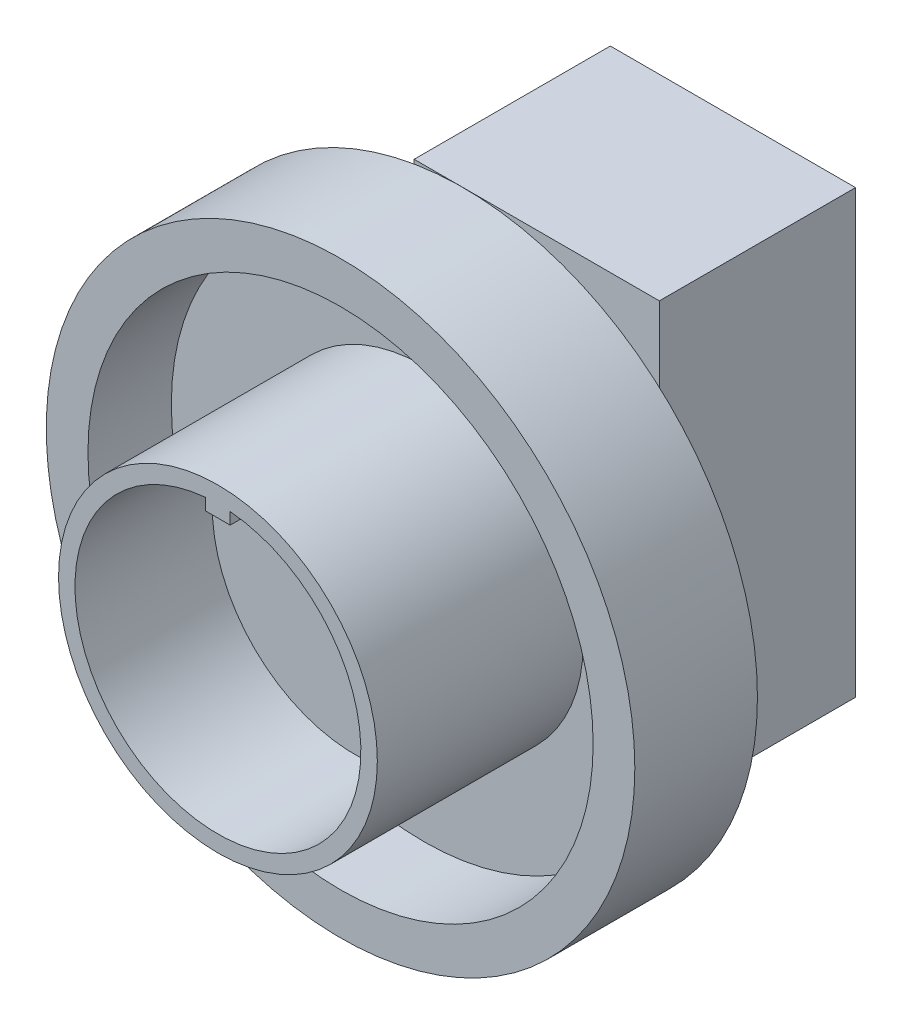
from build123d import *

# Parameters (mm, degrees)
CROQUIS2_W              = 5
CROQUIS2_H              = 5
SALIENTE_EXTRUIR1_DEPTH = 28
CROQUIS3_W              = 50
CROQUIS3_H              = 90
SALIENTE_EXTRUIR2_DEPTH = 40
CROQUIS4_W              = 40.5
CROQUIS4_H              = 81
CORTAR_EXTRUIR1_DEPTH   = 32
CROQUIS5_W              = 22.1
CROQUIS5_H              = 22.1
CORTAR_EXTRUIR2_DEPTH   = 17


with BuildPart() as part:
    # Croquis1 → Revoluci_n1 (revolve)
    with BuildSketch(Plane(origin=(0, 0, 0), x_dir=(0, 0, -1), z_dir=(1, 0, 0)), mode=Mode.PRIVATE) as revoluci_n1_sk:
        Polygon((0, 32.5), (0, 29.15), (28, 29.15), (28, 0), (65, 0), (65, 25), (50, 25), (50, 60), (25, 60), (25, 51.5), (42, 51.5), (42, 32.5), align=None)
    revolve(revoluci_n1_sk.sketch.rotate(Axis((0, 0, 0), (0, 0, -1)), 90), axis=Axis((0, 0, 0), (0, 0, -1)))

    # Croquis2 → Saliente-Extruir1 (add)
    with BuildSketch(Plane.XY):
        with Locations((0, 29.15)):
            Rectangle(CROQUIS2_W, CROQUIS2_H)
    extrude(amount=-SALIENTE_EXTRUIR1_DEPTH)

    # Croquis3 → Saliente-Extruir2 (add)
    with BuildSketch(Plane(origin=(0, 0, -65), x_dir=(-1, 0, 0), z_dir=(0, 0, -1))):
        Rectangle(CROQUIS3_W, CROQUIS3_H)
    extrude(amount=SALIENTE_EXTRUIR2_DEPTH)

    # Croquis4 → Cortar-Extruir1 (cut)
    with BuildSketch(Plane(origin=(0, 0, -105), x_dir=(-1, 0, 0), z_dir=(0, 0, -1))):
        Rectangle(CROQUIS4_W, CROQUIS4_H)
    extrude(amount=-CORTAR_EXTRUIR1_DEPTH, mode=Mode.SUBTRACT)

    # Croquis5 → Cortar-Extruir2 (cut)
    with BuildSketch(Plane(origin=(0, 0, -73), x_dir=(-1, 0, 0), z_dir=(0, 0, -1))):
        Rectangle(CROQUIS5_W, CROQUIS5_H)
    extrude(amount=-CORTAR_EXTRUIR2_DEPTH, mode=Mode.SUBTRACT)


solid = part.part
